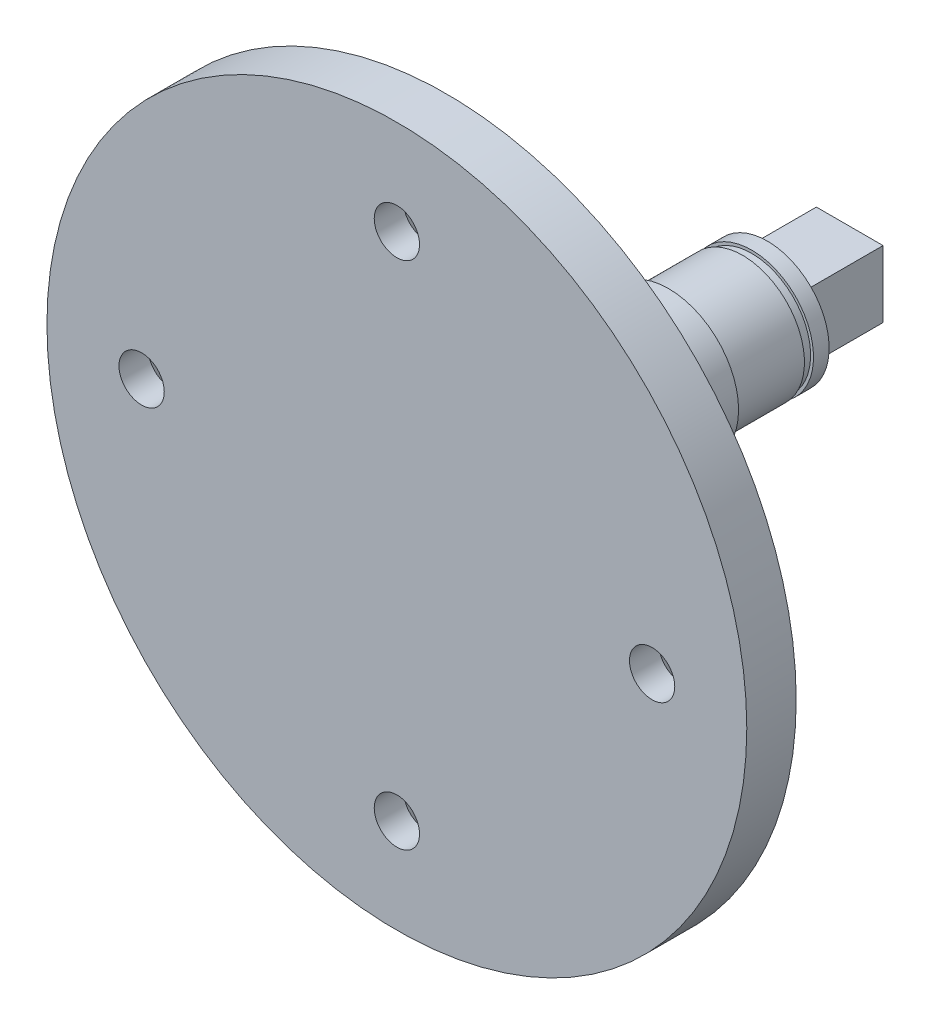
ISO-10303-21;
HEADER;
FILE_DESCRIPTION(('STEP AP214'),'2;1');
FILE_NAME('part.step','',(''),(''),'','','');
FILE_SCHEMA(('AUTOMOTIVE_DESIGN { 1 0 10303 214 1 1 1 1 }'));
ENDSEC;
DATA;
#1=APPLICATION_CONTEXT('core data for automotive mechanical design processes');
#2=APPLICATION_PROTOCOL_DEFINITION('international standard','automotive_design',2000,#1);
#3=PRODUCT_CONTEXT('',#1,'mechanical');
#4=PRODUCT('Part','Part','',(#3));
#5=PRODUCT_RELATED_PRODUCT_CATEGORY('part','',(#4));
#6=PRODUCT_DEFINITION_FORMATION('','',#4);
#7=PRODUCT_DEFINITION_CONTEXT('part definition',#1,'design');
#8=PRODUCT_DEFINITION('design','',#6,#7);
#9=PRODUCT_DEFINITION_SHAPE('','',#8);
#10=(LENGTH_UNIT() NAMED_UNIT(*) SI_UNIT(.MILLI.,.METRE.));
#11=(NAMED_UNIT(*) PLANE_ANGLE_UNIT() SI_UNIT($,.RADIAN.));
#12=(NAMED_UNIT(*) SI_UNIT($,.STERADIAN.) SOLID_ANGLE_UNIT());
#13=UNCERTAINTY_MEASURE_WITH_UNIT(LENGTH_MEASURE(1.E-05),#10,'distance_accuracy_value','');
#14=(GEOMETRIC_REPRESENTATION_CONTEXT(3) GLOBAL_UNCERTAINTY_ASSIGNED_CONTEXT((#13)) GLOBAL_UNIT_ASSIGNED_CONTEXT((#10,
#11,#12)) REPRESENTATION_CONTEXT('',''));
#15=CARTESIAN_POINT('',(0.,0.,0.));
#16=DIRECTION('',(0.,0.,1.));
#17=DIRECTION('',(1.,0.,0.));
#18=AXIS2_PLACEMENT_3D('',#15,#16,#17);
#19=CARTESIAN_POINT('',(0.,0.,-39.));
#20=DIRECTION('',(0.,0.,1.));
#21=DIRECTION('',(1.,0.,0.));
#22=AXIS2_PLACEMENT_3D('',#19,#20,#21);
#23=CYLINDRICAL_SURFACE('',#22,7.5);
#24=CARTESIAN_POINT('',(0.,0.,-27.));
#25=DIRECTION('',(0.,0.,-1.));
#26=DIRECTION('',(-1.,0.,0.));
#27=AXIS2_PLACEMENT_3D('',#24,#25,#26);
#28=CIRCLE('',#27,7.5);
#29=CARTESIAN_POINT('',(-7.5,0.,-27.));
#30=VERTEX_POINT('',#29);
#31=EDGE_CURVE('E117',#30,#30,#28,.T.);
#32=ORIENTED_EDGE('',*,*,#31,.T.);
#33=EDGE_LOOP('',(#32));
#34=FACE_BOUND('',#33,.T.);
#35=CARTESIAN_POINT('',(0.,0.,-36.));
#36=DIRECTION('',(0.,0.,-1.));
#37=DIRECTION('',(-1.,0.,0.));
#38=AXIS2_PLACEMENT_3D('',#35,#36,#37);
#39=CIRCLE('',#38,7.5);
#40=CARTESIAN_POINT('',(-7.5,0.,-36.));
#41=VERTEX_POINT('',#40);
#42=EDGE_CURVE('E400',#41,#41,#39,.T.);
#43=ORIENTED_EDGE('',*,*,#42,.F.);
#44=EDGE_LOOP('',(#43));
#45=FACE_BOUND('',#44,.T.);
#46=ADVANCED_FACE('F36',(#34,#45),#23,.T.);
#47=CARTESIAN_POINT('',(0.,0.,0.));
#48=DIRECTION('',(0.,0.,1.));
#49=DIRECTION('',(1.,0.,0.));
#50=AXIS2_PLACEMENT_3D('',#47,#48,#49);
#51=PLANE('',#50);
#52=CARTESIAN_POINT('',(0.,31.,0.));
#53=DIRECTION('',(0.,0.,-1.));
#54=DIRECTION('',(-1.,0.,0.));
#55=AXIS2_PLACEMENT_3D('',#52,#53,#54);
#56=CIRCLE('',#55,5.2);
#57=CARTESIAN_POINT('',(-5.2,31.,0.));
#58=VERTEX_POINT('',#57);
#59=EDGE_CURVE('E397',#58,#58,#56,.T.);
#60=ORIENTED_EDGE('',*,*,#59,.F.);
#61=EDGE_LOOP('',(#60));
#62=FACE_BOUND('',#61,.T.);
#63=CARTESIAN_POINT('',(-31.0000000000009,8.7687457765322E-13,0.));
#64=DIRECTION('',(0.,0.,-1.));
#65=DIRECTION('',(-1.,0.,0.));
#66=AXIS2_PLACEMENT_3D('',#63,#64,#65);
#67=CIRCLE('',#66,5.2);
#68=CARTESIAN_POINT('',(-36.2000000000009,8.7687457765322E-13,0.));
#69=VERTEX_POINT('',#68);
#70=EDGE_CURVE('E388',#69,#69,#67,.T.);
#71=ORIENTED_EDGE('',*,*,#70,.F.);
#72=EDGE_LOOP('',(#71));
#73=FACE_BOUND('',#72,.T.);
#74=CARTESIAN_POINT('',(-1.75374915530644E-12,-31.,0.));
#75=DIRECTION('',(0.,0.,-1.));
#76=DIRECTION('',(-1.,0.,0.));
#77=AXIS2_PLACEMENT_3D('',#74,#75,#76);
#78=CIRCLE('',#77,5.2);
#79=CARTESIAN_POINT('',(-5.20000000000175,-31.,0.));
#80=VERTEX_POINT('',#79);
#81=EDGE_CURVE('E379',#80,#80,#78,.T.);
#82=ORIENTED_EDGE('',*,*,#81,.F.);
#83=EDGE_LOOP('',(#82));
#84=FACE_BOUND('',#83,.T.);
#85=CARTESIAN_POINT('',(0.,0.,0.));
#86=DIRECTION('',(0.,0.,1.));
#87=DIRECTION('',(1.,0.,0.));
#88=AXIS2_PLACEMENT_3D('',#85,#86,#87);
#89=CIRCLE('',#88,8.5);
#90=CARTESIAN_POINT('',(8.5,0.,0.));
#91=VERTEX_POINT('',#90);
#92=EDGE_CURVE('E12',#91,#91,#89,.F.);
#93=ORIENTED_EDGE('',*,*,#92,.F.);
#94=EDGE_LOOP('',(#93));
#95=FACE_BOUND('',#94,.T.);
#96=CARTESIAN_POINT('',(0.,0.,0.));
#97=DIRECTION('',(0.,0.,1.));
#98=DIRECTION('',(1.,0.,0.));
#99=AXIS2_PLACEMENT_3D('',#96,#97,#98);
#100=CIRCLE('',#99,42.5);
#101=CARTESIAN_POINT('',(42.5,0.,0.));
#102=VERTEX_POINT('',#101);
#103=EDGE_CURVE('E121',#102,#102,#100,.T.);
#104=ORIENTED_EDGE('',*,*,#103,.F.);
#105=EDGE_LOOP('',(#104));
#106=FACE_BOUND('',#105,.T.);
#107=CARTESIAN_POINT('',(30.9999999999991,-8.73078172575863E-13,0.));
#108=DIRECTION('',(0.,0.,-1.));
#109=DIRECTION('',(-1.,0.,0.));
#110=AXIS2_PLACEMENT_3D('',#107,#108,#109);
#111=CIRCLE('',#110,5.2);
#112=CARTESIAN_POINT('',(25.7999999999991,-8.73078172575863E-13,0.));
#113=VERTEX_POINT('',#112);
#114=EDGE_CURVE('E360',#113,#113,#111,.T.);
#115=ORIENTED_EDGE('',*,*,#114,.F.);
#116=EDGE_LOOP('',(#115));
#117=FACE_BOUND('',#116,.T.);
#118=ADVANCED_FACE('F149',(#62,#73,#84,#95,#106,#117),#51,.F.);
#119=CARTESIAN_POINT('',(0.,0.,6.));
#120=DIRECTION('',(0.,0.,-1.));
#121=DIRECTION('',(-1.,0.,0.));
#122=AXIS2_PLACEMENT_3D('',#119,#120,#121);
#123=CYLINDRICAL_SURFACE('',#122,42.5);
#124=CARTESIAN_POINT('',(0.,0.,6.));
#125=DIRECTION('',(0.,0.,1.));
#126=DIRECTION('',(1.,0.,0.));
#127=AXIS2_PLACEMENT_3D('',#124,#125,#126);
#128=CIRCLE('',#127,42.5);
#129=CARTESIAN_POINT('',(42.5,0.,6.));
#130=VERTEX_POINT('',#129);
#131=EDGE_CURVE('E44',#130,#130,#128,.T.);
#132=ORIENTED_EDGE('',*,*,#131,.F.);
#133=EDGE_LOOP('',(#132));
#134=FACE_BOUND('',#133,.T.);
#135=ORIENTED_EDGE('',*,*,#103,.T.);
#136=EDGE_LOOP('',(#135));
#137=FACE_BOUND('',#136,.T.);
#138=ADVANCED_FACE('F38',(#134,#137),#123,.T.);
#139=CARTESIAN_POINT('',(0.,0.,6.));
#140=DIRECTION('',(0.,0.,1.));
#141=DIRECTION('',(1.,0.,0.));
#142=AXIS2_PLACEMENT_3D('',#139,#140,#141);
#143=PLANE('',#142);
#144=CARTESIAN_POINT('',(0.,31.,6.));
#145=DIRECTION('',(0.,0.,1.));
#146=DIRECTION('',(1.,0.,0.));
#147=AXIS2_PLACEMENT_3D('',#144,#145,#146);
#148=CIRCLE('',#147,2.75);
#149=CARTESIAN_POINT('',(2.75,31.,6.));
#150=VERTEX_POINT('',#149);
#151=EDGE_CURVE('E391',#150,#150,#148,.T.);
#152=ORIENTED_EDGE('',*,*,#151,.F.);
#153=EDGE_LOOP('',(#152));
#154=FACE_BOUND('',#153,.T.);
#155=CARTESIAN_POINT('',(-31.0000000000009,8.7687457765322E-13,6.));
#156=DIRECTION('',(0.,0.,1.));
#157=DIRECTION('',(1.,0.,0.));
#158=AXIS2_PLACEMENT_3D('',#155,#156,#157);
#159=CIRCLE('',#158,2.75);
#160=CARTESIAN_POINT('',(-28.2500000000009,8.7687457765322E-13,6.));
#161=VERTEX_POINT('',#160);
#162=EDGE_CURVE('E382',#161,#161,#159,.T.);
#163=ORIENTED_EDGE('',*,*,#162,.F.);
#164=EDGE_LOOP('',(#163));
#165=FACE_BOUND('',#164,.T.);
#166=CARTESIAN_POINT('',(-1.75374915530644E-12,-31.,6.));
#167=DIRECTION('',(0.,0.,1.));
#168=DIRECTION('',(1.,0.,0.));
#169=AXIS2_PLACEMENT_3D('',#166,#167,#168);
#170=CIRCLE('',#169,2.75);
#171=CARTESIAN_POINT('',(2.74999999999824,-31.,6.));
#172=VERTEX_POINT('',#171);
#173=EDGE_CURVE('E363',#172,#172,#170,.T.);
#174=ORIENTED_EDGE('',*,*,#173,.F.);
#175=EDGE_LOOP('',(#174));
#176=FACE_BOUND('',#175,.T.);
#177=CARTESIAN_POINT('',(30.9999999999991,-8.73078172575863E-13,6.));
#178=DIRECTION('',(0.,0.,1.));
#179=DIRECTION('',(1.,0.,0.));
#180=AXIS2_PLACEMENT_3D('',#177,#178,#179);
#181=CIRCLE('',#180,2.75);
#182=CARTESIAN_POINT('',(33.7499999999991,-8.73078172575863E-13,6.));
#183=VERTEX_POINT('',#182);
#184=EDGE_CURVE('E106',#183,#183,#181,.T.);
#185=ORIENTED_EDGE('',*,*,#184,.F.);
#186=EDGE_LOOP('',(#185));
#187=FACE_BOUND('',#186,.T.);
#188=ORIENTED_EDGE('',*,*,#131,.T.);
#189=EDGE_LOOP('',(#188));
#190=FACE_BOUND('',#189,.T.);
#191=ADVANCED_FACE('F139',(#154,#165,#176,#187,#190),#143,.T.);
#192=CARTESIAN_POINT('',(0.,0.,-63.0416305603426));
#193=DIRECTION('',(0.,0.,1.));
#194=DIRECTION('',(1.,0.,0.));
#195=AXIS2_PLACEMENT_3D('',#192,#193,#194);
#196=CYLINDRICAL_SURFACE('',#195,8.5);
#197=ORIENTED_EDGE('',*,*,#92,.T.);
#198=EDGE_LOOP('',(#197));
#199=FACE_BOUND('',#198,.T.);
#200=CARTESIAN_POINT('',(0.,0.,-27.));
#201=DIRECTION('',(0.,0.,-1.));
#202=DIRECTION('',(-1.,0.,0.));
#203=AXIS2_PLACEMENT_3D('',#200,#201,#202);
#204=CIRCLE('',#203,8.5);
#205=CARTESIAN_POINT('',(-8.5,0.,-27.));
#206=VERTEX_POINT('',#205);
#207=EDGE_CURVE('E114',#206,#206,#204,.T.);
#208=ORIENTED_EDGE('',*,*,#207,.F.);
#209=EDGE_LOOP('',(#208));
#210=FACE_BOUND('',#209,.T.);
#211=ADVANCED_FACE('F134',(#199,#210),#196,.T.);
#212=CARTESIAN_POINT('',(0.,0.,-27.));
#213=DIRECTION('',(0.,0.,-1.));
#214=DIRECTION('',(-1.,0.,0.));
#215=AXIS2_PLACEMENT_3D('',#212,#213,#214);
#216=PLANE('',#215);
#217=ORIENTED_EDGE('',*,*,#31,.F.);
#218=EDGE_LOOP('',(#217));
#219=FACE_BOUND('',#218,.T.);
#220=ORIENTED_EDGE('',*,*,#207,.T.);
#221=EDGE_LOOP('',(#220));
#222=FACE_BOUND('',#221,.T.);
#223=ADVANCED_FACE('F130',(#219,#222),#216,.T.);
#224=CARTESIAN_POINT('',(30.9999999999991,-8.73078172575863E-13,0.));
#225=DIRECTION('',(0.,0.,-1.));
#226=DIRECTION('',(-1.,0.,0.));
#227=AXIS2_PLACEMENT_3D('',#224,#225,#226);
#228=CYLINDRICAL_SURFACE('',#227,2.75);
#229=CARTESIAN_POINT('',(30.9999999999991,-8.73078172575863E-13,2.45));
#230=DIRECTION('',(0.,0.,-1.));
#231=DIRECTION('',(-1.,0.,0.));
#232=AXIS2_PLACEMENT_3D('',#229,#230,#231);
#233=CIRCLE('',#232,2.75);
#234=CARTESIAN_POINT('',(28.2499999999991,-8.73078172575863E-13,2.45));
#235=VERTEX_POINT('',#234);
#236=EDGE_CURVE('E362',#235,#235,#233,.T.);
#237=ORIENTED_EDGE('',*,*,#236,.T.);
#238=EDGE_LOOP('',(#237));
#239=FACE_BOUND('',#238,.T.);
#240=ORIENTED_EDGE('',*,*,#184,.T.);
#241=EDGE_LOOP('',(#240));
#242=FACE_BOUND('',#241,.T.);
#243=ADVANCED_FACE('F133',(#239,#242),#228,.F.);
#244=CARTESIAN_POINT('',(30.9999999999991,-8.73078172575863E-13,0.));
#245=DIRECTION('',(0.,0.,-1.));
#246=DIRECTION('',(-1.,0.,0.));
#247=AXIS2_PLACEMENT_3D('',#244,#245,#246);
#248=CONICAL_SURFACE('',#247,5.2,0.785398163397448);
#249=ORIENTED_EDGE('',*,*,#236,.F.);
#250=EDGE_LOOP('',(#249));
#251=FACE_BOUND('',#250,.T.);
#252=ORIENTED_EDGE('',*,*,#114,.T.);
#253=EDGE_LOOP('',(#252));
#254=FACE_BOUND('',#253,.T.);
#255=ADVANCED_FACE('F234',(#251,#254),#248,.F.);
#256=CARTESIAN_POINT('',(-1.75374915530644E-12,-31.,0.));
#257=DIRECTION('',(0.,0.,-1.));
#258=DIRECTION('',(-1.,0.,0.));
#259=AXIS2_PLACEMENT_3D('',#256,#257,#258);
#260=CYLINDRICAL_SURFACE('',#259,2.75);
#261=CARTESIAN_POINT('',(-1.75374915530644E-12,-31.,2.45));
#262=DIRECTION('',(0.,0.,-1.));
#263=DIRECTION('',(-1.,0.,0.));
#264=AXIS2_PLACEMENT_3D('',#261,#262,#263);
#265=CIRCLE('',#264,2.75);
#266=CARTESIAN_POINT('',(-2.75000000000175,-31.,2.45));
#267=VERTEX_POINT('',#266);
#268=EDGE_CURVE('E368',#267,#267,#265,.T.);
#269=ORIENTED_EDGE('',*,*,#268,.T.);
#270=EDGE_LOOP('',(#269));
#271=FACE_BOUND('',#270,.T.);
#272=ORIENTED_EDGE('',*,*,#173,.T.);
#273=EDGE_LOOP('',(#272));
#274=FACE_BOUND('',#273,.T.);
#275=ADVANCED_FACE('F242',(#271,#274),#260,.F.);
#276=CARTESIAN_POINT('',(-1.75374915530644E-12,-31.,0.));
#277=DIRECTION('',(0.,0.,-1.));
#278=DIRECTION('',(-1.,0.,0.));
#279=AXIS2_PLACEMENT_3D('',#276,#277,#278);
#280=CONICAL_SURFACE('',#279,5.2,0.785398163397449);
#281=ORIENTED_EDGE('',*,*,#268,.F.);
#282=EDGE_LOOP('',(#281));
#283=FACE_BOUND('',#282,.T.);
#284=ORIENTED_EDGE('',*,*,#81,.T.);
#285=EDGE_LOOP('',(#284));
#286=FACE_BOUND('',#285,.T.);
#287=ADVANCED_FACE('F251',(#283,#286),#280,.F.);
#288=CARTESIAN_POINT('',(-31.0000000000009,8.7687457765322E-13,0.));
#289=DIRECTION('',(0.,0.,-1.));
#290=DIRECTION('',(-1.,0.,0.));
#291=AXIS2_PLACEMENT_3D('',#288,#289,#290);
#292=CYLINDRICAL_SURFACE('',#291,2.75);
#293=CARTESIAN_POINT('',(-31.0000000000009,8.7687457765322E-13,2.45));
#294=DIRECTION('',(0.,0.,-1.));
#295=DIRECTION('',(-1.,0.,0.));
#296=AXIS2_PLACEMENT_3D('',#293,#294,#295);
#297=CIRCLE('',#296,2.75);
#298=CARTESIAN_POINT('',(-33.7500000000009,8.7687457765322E-13,2.45));
#299=VERTEX_POINT('',#298);
#300=EDGE_CURVE('E385',#299,#299,#297,.T.);
#301=ORIENTED_EDGE('',*,*,#300,.T.);
#302=EDGE_LOOP('',(#301));
#303=FACE_BOUND('',#302,.T.);
#304=ORIENTED_EDGE('',*,*,#162,.T.);
#305=EDGE_LOOP('',(#304));
#306=FACE_BOUND('',#305,.T.);
#307=ADVANCED_FACE('F260',(#303,#306),#292,.F.);
#308=CARTESIAN_POINT('',(-31.0000000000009,8.7687457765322E-13,0.));
#309=DIRECTION('',(0.,0.,-1.));
#310=DIRECTION('',(-1.,0.,0.));
#311=AXIS2_PLACEMENT_3D('',#308,#309,#310);
#312=CONICAL_SURFACE('',#311,5.2,0.785398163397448);
#313=ORIENTED_EDGE('',*,*,#300,.F.);
#314=EDGE_LOOP('',(#313));
#315=FACE_BOUND('',#314,.T.);
#316=ORIENTED_EDGE('',*,*,#70,.T.);
#317=EDGE_LOOP('',(#316));
#318=FACE_BOUND('',#317,.T.);
#319=ADVANCED_FACE('F269',(#315,#318),#312,.F.);
#320=CARTESIAN_POINT('',(0.,31.,0.));
#321=DIRECTION('',(0.,0.,-1.));
#322=DIRECTION('',(-1.,0.,0.));
#323=AXIS2_PLACEMENT_3D('',#320,#321,#322);
#324=CYLINDRICAL_SURFACE('',#323,2.75);
#325=CARTESIAN_POINT('',(0.,31.,2.45));
#326=DIRECTION('',(0.,0.,-1.));
#327=DIRECTION('',(-1.,0.,0.));
#328=AXIS2_PLACEMENT_3D('',#325,#326,#327);
#329=CIRCLE('',#328,2.75);
#330=CARTESIAN_POINT('',(-2.75,31.,2.45));
#331=VERTEX_POINT('',#330);
#332=EDGE_CURVE('E394',#331,#331,#329,.T.);
#333=ORIENTED_EDGE('',*,*,#332,.T.);
#334=EDGE_LOOP('',(#333));
#335=FACE_BOUND('',#334,.T.);
#336=ORIENTED_EDGE('',*,*,#151,.T.);
#337=EDGE_LOOP('',(#336));
#338=FACE_BOUND('',#337,.T.);
#339=ADVANCED_FACE('F278',(#335,#338),#324,.F.);
#340=CARTESIAN_POINT('',(0.,31.,0.));
#341=DIRECTION('',(0.,0.,-1.));
#342=DIRECTION('',(-1.,0.,0.));
#343=AXIS2_PLACEMENT_3D('',#340,#341,#342);
#344=CONICAL_SURFACE('',#343,5.2,0.785398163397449);
#345=ORIENTED_EDGE('',*,*,#332,.F.);
#346=EDGE_LOOP('',(#345));
#347=FACE_BOUND('',#346,.T.);
#348=ORIENTED_EDGE('',*,*,#59,.T.);
#349=EDGE_LOOP('',(#348));
#350=FACE_BOUND('',#349,.T.);
#351=ADVANCED_FACE('F287',(#347,#350),#344,.F.);
#352=CARTESIAN_POINT('',(0.,0.,-37.1));
#353=DIRECTION('',(0.,0.,-1.));
#354=DIRECTION('',(-1.,0.,0.));
#355=AXIS2_PLACEMENT_3D('',#352,#353,#354);
#356=PLANE('',#355);
#357=CARTESIAN_POINT('',(0.,0.,-37.1));
#358=DIRECTION('',(0.,0.,-1.));
#359=DIRECTION('',(-1.,0.,0.));
#360=AXIS2_PLACEMENT_3D('',#357,#358,#359);
#361=CIRCLE('',#360,7.5);
#362=CARTESIAN_POINT('',(-7.5,0.,-37.1));
#363=VERTEX_POINT('',#362);
#364=EDGE_CURVE('E167',#363,#363,#361,.T.);
#365=ORIENTED_EDGE('',*,*,#364,.F.);
#366=EDGE_LOOP('',(#365));
#367=FACE_BOUND('',#366,.T.);
#368=CARTESIAN_POINT('',(0.,0.,-37.1));
#369=DIRECTION('',(0.,0.,-1.));
#370=DIRECTION('',(-1.,0.,0.));
#371=AXIS2_PLACEMENT_3D('',#368,#369,#370);
#372=CIRCLE('',#371,7.15);
#373=CARTESIAN_POINT('',(-7.15,0.,-37.1));
#374=VERTEX_POINT('',#373);
#375=EDGE_CURVE('E403',#374,#374,#372,.T.);
#376=ORIENTED_EDGE('',*,*,#375,.T.);
#377=EDGE_LOOP('',(#376));
#378=FACE_BOUND('',#377,.T.);
#379=ADVANCED_FACE('F296',(#367,#378),#356,.F.);
#380=CARTESIAN_POINT('',(0.,0.,-36.));
#381=DIRECTION('',(0.,0.,-1.));
#382=DIRECTION('',(-1.,0.,0.));
#383=AXIS2_PLACEMENT_3D('',#380,#381,#382);
#384=PLANE('',#383);
#385=ORIENTED_EDGE('',*,*,#42,.T.);
#386=EDGE_LOOP('',(#385));
#387=FACE_BOUND('',#386,.T.);
#388=CARTESIAN_POINT('',(0.,0.,-36.));
#389=DIRECTION('',(0.,0.,-1.));
#390=DIRECTION('',(-1.,0.,0.));
#391=AXIS2_PLACEMENT_3D('',#388,#389,#390);
#392=CIRCLE('',#391,7.15);
#393=CARTESIAN_POINT('',(-7.15,0.,-36.));
#394=VERTEX_POINT('',#393);
#395=EDGE_CURVE('E405',#394,#394,#392,.T.);
#396=ORIENTED_EDGE('',*,*,#395,.F.);
#397=EDGE_LOOP('',(#396));
#398=FACE_BOUND('',#397,.T.);
#399=ADVANCED_FACE('F309',(#387,#398),#384,.T.);
#400=CARTESIAN_POINT('',(0.,0.,-37.1));
#401=DIRECTION('',(0.,0.,1.));
#402=DIRECTION('',(1.,0.,0.));
#403=AXIS2_PLACEMENT_3D('',#400,#401,#402);
#404=CYLINDRICAL_SURFACE('',#403,7.15);
#405=ORIENTED_EDGE('',*,*,#375,.F.);
#406=EDGE_LOOP('',(#405));
#407=FACE_BOUND('',#406,.T.);
#408=ORIENTED_EDGE('',*,*,#395,.T.);
#409=EDGE_LOOP('',(#408));
#410=FACE_BOUND('',#409,.T.);
#411=ADVANCED_FACE('F221',(#407,#410),#404,.T.);
#412=CARTESIAN_POINT('',(0.,0.,-49.));
#413=DIRECTION('',(0.,0.,1.));
#414=DIRECTION('',(1.,0.,0.));
#415=AXIS2_PLACEMENT_3D('',#412,#413,#414);
#416=PLANE('',#415);
#417=DIRECTION('',(0.,-1.,0.));
#418=VECTOR('',#417,1.);
#419=CARTESIAN_POINT('',(4.05,-4.05,-49.));
#420=LINE('',#419,#418);
#421=CARTESIAN_POINT('',(4.05,4.05,-49.));
#422=VERTEX_POINT('',#421);
#423=CARTESIAN_POINT('',(4.05,-4.05,-49.));
#424=VERTEX_POINT('',#423);
#425=EDGE_CURVE('E85',#422,#424,#420,.T.);
#426=ORIENTED_EDGE('',*,*,#425,.T.);
#427=DIRECTION('',(-1.,0.,0.));
#428=VECTOR('',#427,1.);
#429=CARTESIAN_POINT('',(4.05,-4.05,-49.));
#430=LINE('',#429,#428);
#431=CARTESIAN_POINT('',(-4.05,-4.05,-49.));
#432=VERTEX_POINT('',#431);
#433=EDGE_CURVE('E80',#424,#432,#430,.T.);
#434=ORIENTED_EDGE('',*,*,#433,.T.);
#435=DIRECTION('',(0.,1.,0.));
#436=VECTOR('',#435,1.);
#437=CARTESIAN_POINT('',(-4.05,-4.05,-49.));
#438=LINE('',#437,#436);
#439=CARTESIAN_POINT('',(-4.05,4.05,-49.));
#440=VERTEX_POINT('',#439);
#441=EDGE_CURVE('E83',#432,#440,#438,.T.);
#442=ORIENTED_EDGE('',*,*,#441,.T.);
#443=DIRECTION('',(1.,0.,0.));
#444=VECTOR('',#443,1.);
#445=CARTESIAN_POINT('',(4.05,4.05,-49.));
#446=LINE('',#445,#444);
#447=EDGE_CURVE('E59',#440,#422,#446,.T.);
#448=ORIENTED_EDGE('',*,*,#447,.T.);
#449=EDGE_LOOP('',(#426,#434,#442,#448));
#450=FACE_BOUND('',#449,.T.);
#451=ADVANCED_FACE('F81',(#450),#416,.F.);
#452=CARTESIAN_POINT('',(-4.05,-4.05,-49.));
#453=DIRECTION('',(1.,0.,0.));
#454=DIRECTION('',(0.,1.,0.));
#455=AXIS2_PLACEMENT_3D('',#452,#453,#454);
#456=PLANE('',#455);
#457=DIRECTION('',(0.,1.,0.));
#458=VECTOR('',#457,1.);
#459=CARTESIAN_POINT('',(-4.05,-4.05,-39.));
#460=LINE('',#459,#458);
#461=CARTESIAN_POINT('',(-4.05,-4.05,-39.));
#462=VERTEX_POINT('',#461);
#463=CARTESIAN_POINT('',(-4.05,4.05,-39.));
#464=VERTEX_POINT('',#463);
#465=EDGE_CURVE('E108',#462,#464,#460,.T.);
#466=ORIENTED_EDGE('',*,*,#465,.T.);
#467=DIRECTION('',(0.,0.,1.));
#468=VECTOR('',#467,1.);
#469=CARTESIAN_POINT('',(-4.05,4.05,-49.));
#470=LINE('',#469,#468);
#471=EDGE_CURVE('E51',#440,#464,#470,.T.);
#472=ORIENTED_EDGE('',*,*,#471,.F.);
#473=ORIENTED_EDGE('',*,*,#441,.F.);
#474=DIRECTION('',(0.,0.,1.));
#475=VECTOR('',#474,1.);
#476=CARTESIAN_POINT('',(-4.05,-4.05,-49.));
#477=LINE('',#476,#475);
#478=EDGE_CURVE('E89',#432,#462,#477,.T.);
#479=ORIENTED_EDGE('',*,*,#478,.T.);
#480=EDGE_LOOP('',(#466,#472,#473,#479));
#481=FACE_BOUND('',#480,.T.);
#482=ADVANCED_FACE('F97',(#481),#456,.F.);
#483=CARTESIAN_POINT('',(4.05,4.05,-49.));
#484=DIRECTION('',(0.,-1.,0.));
#485=DIRECTION('',(1.,0.,0.));
#486=AXIS2_PLACEMENT_3D('',#483,#484,#485);
#487=PLANE('',#486);
#488=DIRECTION('',(1.,0.,0.));
#489=VECTOR('',#488,1.);
#490=CARTESIAN_POINT('',(4.05,4.05,-39.));
#491=LINE('',#490,#489);
#492=CARTESIAN_POINT('',(4.05,4.05,-39.));
#493=VERTEX_POINT('',#492);
#494=EDGE_CURVE('E73',#464,#493,#491,.T.);
#495=ORIENTED_EDGE('',*,*,#494,.T.);
#496=DIRECTION('',(0.,0.,1.));
#497=VECTOR('',#496,1.);
#498=CARTESIAN_POINT('',(4.05,4.05,-49.));
#499=LINE('',#498,#497);
#500=EDGE_CURVE('E99',#422,#493,#499,.T.);
#501=ORIENTED_EDGE('',*,*,#500,.F.);
#502=ORIENTED_EDGE('',*,*,#447,.F.);
#503=ORIENTED_EDGE('',*,*,#471,.T.);
#504=EDGE_LOOP('',(#495,#501,#502,#503));
#505=FACE_BOUND('',#504,.T.);
#506=ADVANCED_FACE('F173',(#505),#487,.F.);
#507=CARTESIAN_POINT('',(4.05,-4.05,-49.));
#508=DIRECTION('',(-1.,0.,0.));
#509=DIRECTION('',(0.,0.,1.));
#510=AXIS2_PLACEMENT_3D('',#507,#508,#509);
#511=PLANE('',#510);
#512=DIRECTION('',(0.,-1.,0.));
#513=VECTOR('',#512,1.);
#514=CARTESIAN_POINT('',(4.05,-4.05,-39.));
#515=LINE('',#514,#513);
#516=CARTESIAN_POINT('',(4.05,-4.05,-39.));
#517=VERTEX_POINT('',#516);
#518=EDGE_CURVE('E103',#493,#517,#515,.T.);
#519=ORIENTED_EDGE('',*,*,#518,.T.);
#520=DIRECTION('',(0.,0.,1.));
#521=VECTOR('',#520,1.);
#522=CARTESIAN_POINT('',(4.05,-4.05,-49.));
#523=LINE('',#522,#521);
#524=EDGE_CURVE('E95',#424,#517,#523,.T.);
#525=ORIENTED_EDGE('',*,*,#524,.F.);
#526=ORIENTED_EDGE('',*,*,#425,.F.);
#527=ORIENTED_EDGE('',*,*,#500,.T.);
#528=EDGE_LOOP('',(#519,#525,#526,#527));
#529=FACE_BOUND('',#528,.T.);
#530=ADVANCED_FACE('F172',(#529),#511,.F.);
#531=CARTESIAN_POINT('',(4.05,-4.05,-49.));
#532=DIRECTION('',(0.,1.,0.));
#533=DIRECTION('',(-1.,0.,0.));
#534=AXIS2_PLACEMENT_3D('',#531,#532,#533);
#535=PLANE('',#534);
#536=DIRECTION('',(-1.,0.,0.));
#537=VECTOR('',#536,1.);
#538=CARTESIAN_POINT('',(4.05,-4.05,-39.));
#539=LINE('',#538,#537);
#540=EDGE_CURVE('E92',#517,#462,#539,.T.);
#541=ORIENTED_EDGE('',*,*,#540,.T.);
#542=ORIENTED_EDGE('',*,*,#478,.F.);
#543=ORIENTED_EDGE('',*,*,#433,.F.);
#544=ORIENTED_EDGE('',*,*,#524,.T.);
#545=EDGE_LOOP('',(#541,#542,#543,#544));
#546=FACE_BOUND('',#545,.T.);
#547=ADVANCED_FACE('F90',(#546),#535,.F.);
#548=CARTESIAN_POINT('',(0.,0.,-39.));
#549=DIRECTION('',(0.,0.,-1.));
#550=DIRECTION('',(-1.,0.,0.));
#551=AXIS2_PLACEMENT_3D('',#548,#549,#550);
#552=PLANE('',#551);
#553=CARTESIAN_POINT('',(0.,0.,-39.));
#554=DIRECTION('',(0.,0.,-1.));
#555=DIRECTION('',(-1.,0.,0.));
#556=AXIS2_PLACEMENT_3D('',#553,#554,#555);
#557=CIRCLE('',#556,7.5);
#558=CARTESIAN_POINT('',(-7.5,0.,-39.));
#559=VERTEX_POINT('',#558);
#560=EDGE_CURVE('E118',#559,#559,#557,.T.);
#561=ORIENTED_EDGE('',*,*,#560,.T.);
#562=EDGE_LOOP('',(#561));
#563=FACE_BOUND('',#562,.T.);
#564=ORIENTED_EDGE('',*,*,#540,.F.);
#565=ORIENTED_EDGE('',*,*,#518,.F.);
#566=ORIENTED_EDGE('',*,*,#494,.F.);
#567=ORIENTED_EDGE('',*,*,#465,.F.);
#568=EDGE_LOOP('',(#564,#565,#566,#567));
#569=FACE_BOUND('',#568,.T.);
#570=ADVANCED_FACE('F158',(#563,#569),#552,.T.);
#571=ORIENTED_EDGE('',*,*,#364,.T.);
#572=EDGE_LOOP('',(#571));
#573=FACE_BOUND('',#572,.T.);
#574=ORIENTED_EDGE('',*,*,#560,.F.);
#575=EDGE_LOOP('',(#574));
#576=FACE_BOUND('',#575,.T.);
#577=ADVANCED_FACE('F151',(#573,#576),#23,.T.);
#578=CLOSED_SHELL('',(#46,#118,#138,#191,#211,#223,#243,#255,#275,#287,#307,#319,#339,#351,#379,
#399,#411,#451,#482,#506,#530,#547,#570,#577));
#579=MANIFOLD_SOLID_BREP('B2',#578);
#580=ADVANCED_BREP_SHAPE_REPRESENTATION('',(#18,#579),#14);
#581=SHAPE_DEFINITION_REPRESENTATION(#9,#580);
ENDSEC;
END-ISO-10303-21;
